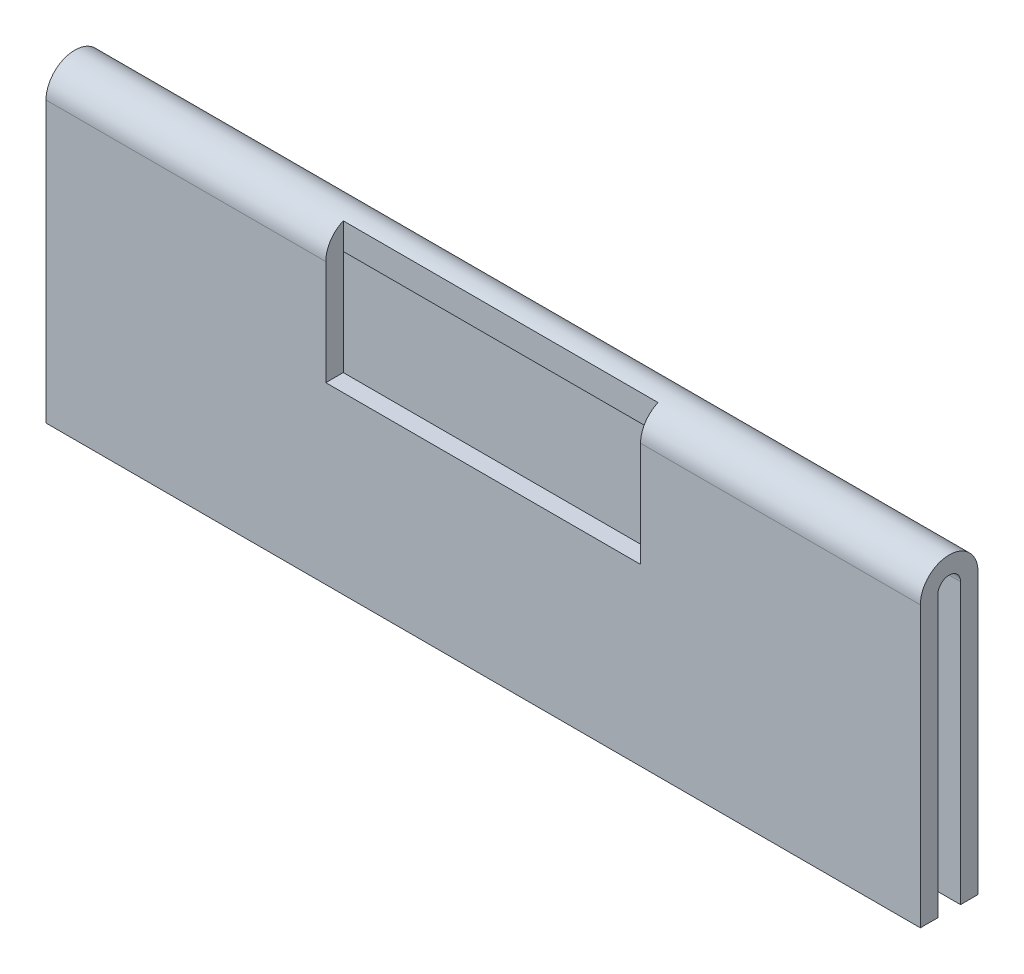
from build123d import *

# Parameters (mm, degrees)
SCHIZZO1_W                   = 250
SCHIZZO1_H                   = 80
ESTRUSIONE_ESTRUSIONE1_DEPTH = 5
SCHIZZO2_W                   = 250
SCHIZZO2_H                   = 5
RIVOLUZIONE1_ANGLE           = 180
SCHIZZO3_W                   = 250
SCHIZZO3_H                   = 5
ESTRUSIONE_ESTRUSIONE2_DEPTH = 80
TAGLIO_ESTRUSIONE1_START     = -50
SCHIZZO4_W                   = 90
SCHIZZO4_H                   = 5
TAGLIO_ESTRUSIONE1_DEPTH     = 80


with BuildPart() as part:
    # Schizzo1 → Estrusione-Estrusione1 (new body)
    with BuildSketch(Plane.XY):
        Rectangle(SCHIZZO1_W, SCHIZZO1_H)
    extrude(amount=ESTRUSIONE_ESTRUSIONE1_DEPTH)

    # Schizzo2 → Rivoluzione1 (revolve)
    with BuildSketch(Plane(origin=(0, 40, 0), x_dir=(1, 0, 0), z_dir=(0, 1, 0))):
        with Locations((0, -2.5)):
            Rectangle(SCHIZZO2_W, SCHIZZO2_H)
    revolve(axis=Axis((-125, 40, 8.241815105), (1, 0, 0)), revolution_arc=RIVOLUZIONE1_ANGLE)

    # Schizzo3 → Estrusione-Estrusione2 (add)
    with BuildSketch(Plane.XZ.offset(-40)):
        with Locations((0, 13.983630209)):
            Rectangle(SCHIZZO3_W, SCHIZZO3_H)
    extrude(amount=ESTRUSIONE_ESTRUSIONE2_DEPTH)

    # Schizzo4 → Taglio-Estrusione1 (cut)
    with BuildSketch(Plane.XZ.offset(40).offset(TAGLIO_ESTRUSIONE1_START)):
        with Locations((0, 13.983630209)):
            Rectangle(SCHIZZO4_W, SCHIZZO4_H)
    extrude(amount=-TAGLIO_ESTRUSIONE1_DEPTH, mode=Mode.SUBTRACT)


solid = part.part
